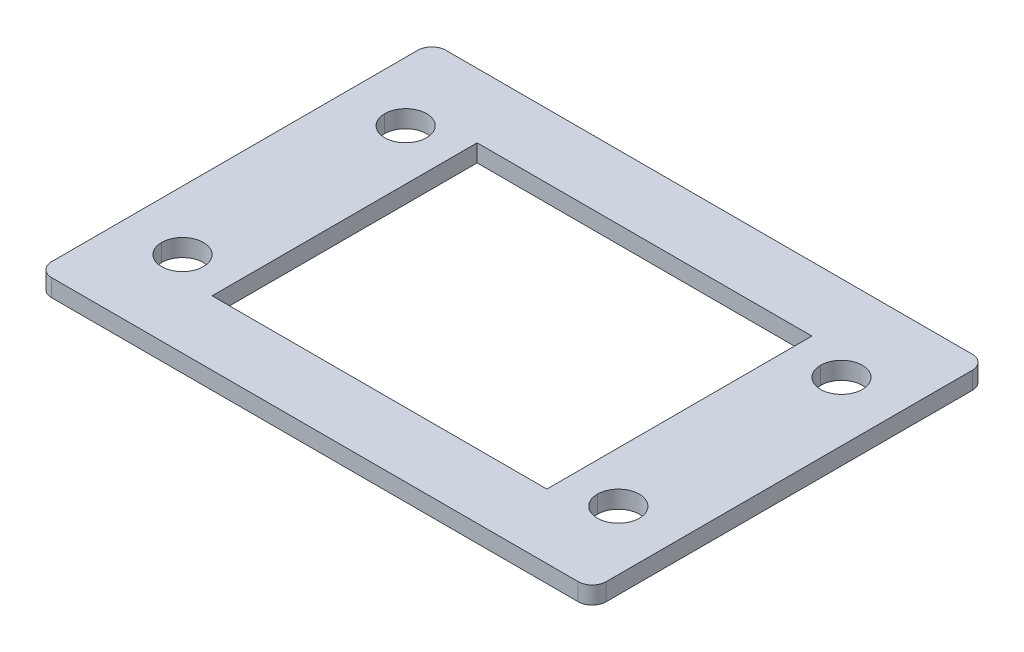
ISO-10303-21;
HEADER;
FILE_DESCRIPTION(('STEP AP214'),'2;1');
FILE_NAME('part.step','',(''),(''),'','','');
FILE_SCHEMA(('AUTOMOTIVE_DESIGN { 1 0 10303 214 1 1 1 1 }'));
ENDSEC;
DATA;
#1=APPLICATION_CONTEXT('core data for automotive mechanical design processes');
#2=APPLICATION_PROTOCOL_DEFINITION('international standard','automotive_design',2000,#1);
#3=PRODUCT_CONTEXT('',#1,'mechanical');
#4=PRODUCT('Part','Part','',(#3));
#5=PRODUCT_RELATED_PRODUCT_CATEGORY('part','',(#4));
#6=PRODUCT_DEFINITION_FORMATION('','',#4);
#7=PRODUCT_DEFINITION_CONTEXT('part definition',#1,'design');
#8=PRODUCT_DEFINITION('design','',#6,#7);
#9=PRODUCT_DEFINITION_SHAPE('','',#8);
#10=(LENGTH_UNIT() NAMED_UNIT(*) SI_UNIT(.MILLI.,.METRE.));
#11=(NAMED_UNIT(*) PLANE_ANGLE_UNIT() SI_UNIT($,.RADIAN.));
#12=(NAMED_UNIT(*) SI_UNIT($,.STERADIAN.) SOLID_ANGLE_UNIT());
#13=UNCERTAINTY_MEASURE_WITH_UNIT(LENGTH_MEASURE(1.E-05),#10,'distance_accuracy_value','');
#14=(GEOMETRIC_REPRESENTATION_CONTEXT(3) GLOBAL_UNCERTAINTY_ASSIGNED_CONTEXT((#13)) GLOBAL_UNIT_ASSIGNED_CONTEXT((#10,
#11,#12)) REPRESENTATION_CONTEXT('',''));
#15=CARTESIAN_POINT('',(0.,0.,0.));
#16=DIRECTION('',(0.,0.,1.));
#17=DIRECTION('',(1.,0.,0.));
#18=AXIS2_PLACEMENT_3D('',#15,#16,#17);
#19=CARTESIAN_POINT('',(31.25,-10.9852813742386,-35.75));
#20=DIRECTION('',(0.,1.,0.));
#21=DIRECTION('',(-1.,0.,0.));
#22=AXIS2_PLACEMENT_3D('',#19,#20,#21);
#23=CYLINDRICAL_SURFACE('',#22,3.);
#24=DIRECTION('',(0.,1.,0.));
#25=VECTOR('',#24,1.);
#26=CARTESIAN_POINT('',(34.25,-10.9852813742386,-35.75));
#27=LINE('',#26,#25);
#28=CARTESIAN_POINT('',(34.25,-2.5,-35.75));
#29=VERTEX_POINT('',#28);
#30=CARTESIAN_POINT('',(34.25,0.,-35.75));
#31=VERTEX_POINT('',#30);
#32=EDGE_CURVE('E209',#29,#31,#27,.T.);
#33=ORIENTED_EDGE('',*,*,#32,.F.);
#34=CARTESIAN_POINT('',(31.25,-2.5,-35.75));
#35=DIRECTION('',(0.,1.,0.));
#36=DIRECTION('',(-1.,0.,0.));
#37=AXIS2_PLACEMENT_3D('',#34,#35,#36);
#38=CIRCLE('',#37,3.);
#39=CARTESIAN_POINT('',(28.25,-2.5,-35.75));
#40=VERTEX_POINT('',#39);
#41=EDGE_CURVE('E195',#40,#29,#38,.T.);
#42=ORIENTED_EDGE('',*,*,#41,.F.);
#43=DIRECTION('',(0.,1.,0.));
#44=VECTOR('',#43,1.);
#45=CARTESIAN_POINT('',(28.25,-10.9852813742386,-35.75));
#46=LINE('',#45,#44);
#47=CARTESIAN_POINT('',(28.25,0.,-35.75));
#48=VERTEX_POINT('',#47);
#49=EDGE_CURVE('E218',#40,#48,#46,.T.);
#50=ORIENTED_EDGE('',*,*,#49,.T.);
#51=CARTESIAN_POINT('',(31.25,0.,-35.75));
#52=DIRECTION('',(0.,-1.,0.));
#53=DIRECTION('',(1.,0.,0.));
#54=AXIS2_PLACEMENT_3D('',#51,#52,#53);
#55=CIRCLE('',#54,3.);
#56=EDGE_CURVE('E210',#31,#48,#55,.T.);
#57=ORIENTED_EDGE('',*,*,#56,.F.);
#58=EDGE_LOOP('',(#33,#42,#50,#57));
#59=FACE_BOUND('',#58,.T.);
#60=ADVANCED_FACE('F15',(#59),#23,.F.);
#61=CARTESIAN_POINT('',(-31.25,-10.9852813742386,-35.75));
#62=DIRECTION('',(0.,1.,0.));
#63=DIRECTION('',(-1.,0.,0.));
#64=AXIS2_PLACEMENT_3D('',#61,#62,#63);
#65=CYLINDRICAL_SURFACE('',#64,3.);
#66=DIRECTION('',(0.,1.,0.));
#67=VECTOR('',#66,1.);
#68=CARTESIAN_POINT('',(-28.25,-10.9852813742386,-35.75));
#69=LINE('',#68,#67);
#70=CARTESIAN_POINT('',(-28.25,-2.5,-35.75));
#71=VERTEX_POINT('',#70);
#72=CARTESIAN_POINT('',(-28.25,0.,-35.75));
#73=VERTEX_POINT('',#72);
#74=EDGE_CURVE('E245',#71,#73,#69,.T.);
#75=ORIENTED_EDGE('',*,*,#74,.F.);
#76=CARTESIAN_POINT('',(-31.25,-2.5,-35.75));
#77=DIRECTION('',(0.,1.,0.));
#78=DIRECTION('',(-1.,0.,0.));
#79=AXIS2_PLACEMENT_3D('',#76,#77,#78);
#80=CIRCLE('',#79,3.);
#81=CARTESIAN_POINT('',(-34.25,-2.5,-35.75));
#82=VERTEX_POINT('',#81);
#83=EDGE_CURVE('E206',#82,#71,#80,.T.);
#84=ORIENTED_EDGE('',*,*,#83,.F.);
#85=DIRECTION('',(0.,1.,0.));
#86=VECTOR('',#85,1.);
#87=CARTESIAN_POINT('',(-34.25,-10.9852813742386,-35.75));
#88=LINE('',#87,#86);
#89=CARTESIAN_POINT('',(-34.25,0.,-35.75));
#90=VERTEX_POINT('',#89);
#91=EDGE_CURVE('E264',#82,#90,#88,.T.);
#92=ORIENTED_EDGE('',*,*,#91,.T.);
#93=CARTESIAN_POINT('',(-31.25,0.,-35.75));
#94=DIRECTION('',(0.,-1.,0.));
#95=DIRECTION('',(1.,0.,0.));
#96=AXIS2_PLACEMENT_3D('',#93,#94,#95);
#97=CIRCLE('',#96,3.);
#98=EDGE_CURVE('E256',#73,#90,#97,.T.);
#99=ORIENTED_EDGE('',*,*,#98,.F.);
#100=EDGE_LOOP('',(#75,#84,#92,#99));
#101=FACE_BOUND('',#100,.T.);
#102=ADVANCED_FACE('F445',(#101),#65,.F.);
#103=CARTESIAN_POINT('',(37.75,-2.5,-25.5));
#104=DIRECTION('',(0.,1.,0.));
#105=DIRECTION('',(-1.,0.,0.));
#106=AXIS2_PLACEMENT_3D('',#103,#104,#105);
#107=CYLINDRICAL_SURFACE('',#106,2.);
#108=CARTESIAN_POINT('',(37.75,-2.5,-25.5));
#109=DIRECTION('',(0.,-1.,0.));
#110=DIRECTION('',(-1.,0.,0.));
#111=AXIS2_PLACEMENT_3D('',#108,#109,#110);
#112=CIRCLE('',#111,2.);
#113=CARTESIAN_POINT('',(39.75,-2.5,-25.5));
#114=VERTEX_POINT('',#113);
#115=CARTESIAN_POINT('',(37.75,-2.5,-23.5));
#116=VERTEX_POINT('',#115);
#117=EDGE_CURVE('E319',#114,#116,#112,.T.);
#118=ORIENTED_EDGE('',*,*,#117,.F.);
#119=DIRECTION('',(0.,-1.,0.));
#120=VECTOR('',#119,1.);
#121=CARTESIAN_POINT('',(39.75,-2.5,-25.5));
#122=LINE('',#121,#120);
#123=CARTESIAN_POINT('',(39.75,0.,-25.5));
#124=VERTEX_POINT('',#123);
#125=EDGE_CURVE('E327',#124,#114,#122,.T.);
#126=ORIENTED_EDGE('',*,*,#125,.F.);
#127=CARTESIAN_POINT('',(37.75,0.,-25.5));
#128=DIRECTION('',(0.,1.,0.));
#129=DIRECTION('',(-1.,0.,0.));
#130=AXIS2_PLACEMENT_3D('',#127,#128,#129);
#131=CIRCLE('',#130,2.);
#132=CARTESIAN_POINT('',(37.75,0.,-23.5));
#133=VERTEX_POINT('',#132);
#134=EDGE_CURVE('E365',#133,#124,#131,.T.);
#135=ORIENTED_EDGE('',*,*,#134,.F.);
#136=DIRECTION('',(0.,1.,0.));
#137=VECTOR('',#136,1.);
#138=CARTESIAN_POINT('',(37.75,-2.5,-23.5));
#139=LINE('',#138,#137);
#140=EDGE_CURVE('E410',#116,#133,#139,.T.);
#141=ORIENTED_EDGE('',*,*,#140,.F.);
#142=EDGE_LOOP('',(#118,#126,#135,#141));
#143=FACE_BOUND('',#142,.T.);
#144=ADVANCED_FACE('F449',(#143),#107,.T.);
#145=CARTESIAN_POINT('',(37.75,-2.5,-78.));
#146=DIRECTION('',(0.,1.,0.));
#147=DIRECTION('',(-1.,0.,0.));
#148=AXIS2_PLACEMENT_3D('',#145,#146,#147);
#149=CYLINDRICAL_SURFACE('',#148,2.);
#150=CARTESIAN_POINT('',(37.75,-2.5,-78.));
#151=DIRECTION('',(0.,-1.,0.));
#152=DIRECTION('',(-1.,0.,0.));
#153=AXIS2_PLACEMENT_3D('',#150,#151,#152);
#154=CIRCLE('',#153,2.);
#155=CARTESIAN_POINT('',(37.75,-2.5,-80.));
#156=VERTEX_POINT('',#155);
#157=CARTESIAN_POINT('',(39.75,-2.5,-78.));
#158=VERTEX_POINT('',#157);
#159=EDGE_CURVE('E311',#156,#158,#154,.T.);
#160=ORIENTED_EDGE('',*,*,#159,.F.);
#161=DIRECTION('',(0.,-1.,0.));
#162=VECTOR('',#161,1.);
#163=CARTESIAN_POINT('',(37.75,-2.5,-80.));
#164=LINE('',#163,#162);
#165=CARTESIAN_POINT('',(37.75,0.,-80.));
#166=VERTEX_POINT('',#165);
#167=EDGE_CURVE('E328',#166,#156,#164,.T.);
#168=ORIENTED_EDGE('',*,*,#167,.F.);
#169=CARTESIAN_POINT('',(37.75,0.,-78.));
#170=DIRECTION('',(0.,1.,0.));
#171=DIRECTION('',(-1.,0.,0.));
#172=AXIS2_PLACEMENT_3D('',#169,#170,#171);
#173=CIRCLE('',#172,2.);
#174=CARTESIAN_POINT('',(39.75,0.,-78.));
#175=VERTEX_POINT('',#174);
#176=EDGE_CURVE('E373',#175,#166,#173,.T.);
#177=ORIENTED_EDGE('',*,*,#176,.F.);
#178=DIRECTION('',(0.,1.,0.));
#179=VECTOR('',#178,1.);
#180=CARTESIAN_POINT('',(39.75,-2.5,-78.));
#181=LINE('',#180,#179);
#182=EDGE_CURVE('E324',#158,#175,#181,.T.);
#183=ORIENTED_EDGE('',*,*,#182,.F.);
#184=EDGE_LOOP('',(#160,#168,#177,#183));
#185=FACE_BOUND('',#184,.T.);
#186=ADVANCED_FACE('F454',(#185),#149,.T.);
#187=CARTESIAN_POINT('',(-37.75,-2.5,-78.));
#188=DIRECTION('',(0.,1.,0.));
#189=DIRECTION('',(-1.,0.,0.));
#190=AXIS2_PLACEMENT_3D('',#187,#188,#189);
#191=CYLINDRICAL_SURFACE('',#190,2.);
#192=CARTESIAN_POINT('',(-37.75,-2.5,-78.));
#193=DIRECTION('',(0.,-1.,0.));
#194=DIRECTION('',(-1.,0.,0.));
#195=AXIS2_PLACEMENT_3D('',#192,#193,#194);
#196=CIRCLE('',#195,2.);
#197=CARTESIAN_POINT('',(-39.75,-2.5,-78.));
#198=VERTEX_POINT('',#197);
#199=CARTESIAN_POINT('',(-37.75,-2.5,-80.));
#200=VERTEX_POINT('',#199);
#201=EDGE_CURVE('E299',#198,#200,#196,.T.);
#202=ORIENTED_EDGE('',*,*,#201,.F.);
#203=DIRECTION('',(0.,-1.,0.));
#204=VECTOR('',#203,1.);
#205=CARTESIAN_POINT('',(-39.75,-2.5,-78.));
#206=LINE('',#205,#204);
#207=CARTESIAN_POINT('',(-39.75,0.,-78.));
#208=VERTEX_POINT('',#207);
#209=EDGE_CURVE('E307',#208,#198,#206,.T.);
#210=ORIENTED_EDGE('',*,*,#209,.F.);
#211=CARTESIAN_POINT('',(-37.75,0.,-78.));
#212=DIRECTION('',(0.,1.,0.));
#213=DIRECTION('',(-1.,0.,0.));
#214=AXIS2_PLACEMENT_3D('',#211,#212,#213);
#215=CIRCLE('',#214,2.);
#216=CARTESIAN_POINT('',(-37.75,0.,-80.));
#217=VERTEX_POINT('',#216);
#218=EDGE_CURVE('E260',#217,#208,#215,.T.);
#219=ORIENTED_EDGE('',*,*,#218,.F.);
#220=DIRECTION('',(0.,1.,0.));
#221=VECTOR('',#220,1.);
#222=CARTESIAN_POINT('',(-37.75,-2.5,-80.));
#223=LINE('',#222,#221);
#224=EDGE_CURVE('E400',#200,#217,#223,.T.);
#225=ORIENTED_EDGE('',*,*,#224,.F.);
#226=EDGE_LOOP('',(#202,#210,#219,#225));
#227=FACE_BOUND('',#226,.T.);
#228=ADVANCED_FACE('F461',(#227),#191,.T.);
#229=CARTESIAN_POINT('',(-37.75,-2.5,-25.5));
#230=DIRECTION('',(0.,1.,0.));
#231=DIRECTION('',(-1.,0.,0.));
#232=AXIS2_PLACEMENT_3D('',#229,#230,#231);
#233=CYLINDRICAL_SURFACE('',#232,2.);
#234=CARTESIAN_POINT('',(-37.75,-2.5,-25.5));
#235=DIRECTION('',(0.,-1.,0.));
#236=DIRECTION('',(-1.,0.,0.));
#237=AXIS2_PLACEMENT_3D('',#234,#235,#236);
#238=CIRCLE('',#237,2.);
#239=CARTESIAN_POINT('',(-37.75,-2.5,-23.5));
#240=VERTEX_POINT('',#239);
#241=CARTESIAN_POINT('',(-39.75,-2.5,-25.5));
#242=VERTEX_POINT('',#241);
#243=EDGE_CURVE('E291',#240,#242,#238,.T.);
#244=ORIENTED_EDGE('',*,*,#243,.F.);
#245=DIRECTION('',(0.,-1.,0.));
#246=VECTOR('',#245,1.);
#247=CARTESIAN_POINT('',(-37.75,-2.5,-23.5));
#248=LINE('',#247,#246);
#249=CARTESIAN_POINT('',(-37.75,0.,-23.5));
#250=VERTEX_POINT('',#249);
#251=EDGE_CURVE('E407',#250,#240,#248,.T.);
#252=ORIENTED_EDGE('',*,*,#251,.F.);
#253=CARTESIAN_POINT('',(-37.75,0.,-25.5));
#254=DIRECTION('',(0.,1.,0.));
#255=DIRECTION('',(-1.,0.,0.));
#256=AXIS2_PLACEMENT_3D('',#253,#254,#255);
#257=CIRCLE('',#256,2.);
#258=CARTESIAN_POINT('',(-39.75,0.,-25.5));
#259=VERTEX_POINT('',#258);
#260=EDGE_CURVE('E357',#259,#250,#257,.T.);
#261=ORIENTED_EDGE('',*,*,#260,.F.);
#262=DIRECTION('',(0.,1.,0.));
#263=VECTOR('',#262,1.);
#264=CARTESIAN_POINT('',(-39.75,-2.5,-25.5));
#265=LINE('',#264,#263);
#266=EDGE_CURVE('E304',#242,#259,#265,.T.);
#267=ORIENTED_EDGE('',*,*,#266,.F.);
#268=EDGE_LOOP('',(#244,#252,#261,#267));
#269=FACE_BOUND('',#268,.T.);
#270=ADVANCED_FACE('F465',(#269),#233,.T.);
#271=CARTESIAN_POINT('',(31.25,-63.7209114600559,-67.75));
#272=DIRECTION('',(0.,1.,0.));
#273=DIRECTION('',(-1.,0.,0.));
#274=AXIS2_PLACEMENT_3D('',#271,#272,#273);
#275=CYLINDRICAL_SURFACE('',#274,3.);
#276=DIRECTION('',(0.,1.,0.));
#277=VECTOR('',#276,1.);
#278=CARTESIAN_POINT('',(34.25,-63.7209114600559,-67.75));
#279=LINE('',#278,#277);
#280=CARTESIAN_POINT('',(34.25,-2.5,-67.75));
#281=VERTEX_POINT('',#280);
#282=CARTESIAN_POINT('',(34.25,0.,-67.75));
#283=VERTEX_POINT('',#282);
#284=EDGE_CURVE('E223',#281,#283,#279,.T.);
#285=ORIENTED_EDGE('',*,*,#284,.F.);
#286=CARTESIAN_POINT('',(31.25,-2.5,-67.75));
#287=DIRECTION('',(0.,1.,0.));
#288=DIRECTION('',(-1.,0.,0.));
#289=AXIS2_PLACEMENT_3D('',#286,#287,#288);
#290=CIRCLE('',#289,3.);
#291=CARTESIAN_POINT('',(28.25,-2.5,-67.75));
#292=VERTEX_POINT('',#291);
#293=EDGE_CURVE('E229',#292,#281,#290,.T.);
#294=ORIENTED_EDGE('',*,*,#293,.F.);
#295=DIRECTION('',(0.,1.,0.));
#296=VECTOR('',#295,1.);
#297=CARTESIAN_POINT('',(28.25,-63.7209114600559,-67.75));
#298=LINE('',#297,#296);
#299=CARTESIAN_POINT('',(28.25,0.,-67.75));
#300=VERTEX_POINT('',#299);
#301=EDGE_CURVE('E238',#292,#300,#298,.T.);
#302=ORIENTED_EDGE('',*,*,#301,.T.);
#303=CARTESIAN_POINT('',(31.25,0.,-67.75));
#304=DIRECTION('',(0.,-1.,0.));
#305=DIRECTION('',(-1.,0.,0.));
#306=AXIS2_PLACEMENT_3D('',#303,#304,#305);
#307=CIRCLE('',#306,3.);
#308=EDGE_CURVE('E345',#283,#300,#307,.T.);
#309=ORIENTED_EDGE('',*,*,#308,.F.);
#310=EDGE_LOOP('',(#285,#294,#302,#309));
#311=FACE_BOUND('',#310,.T.);
#312=ADVANCED_FACE('F469',(#311),#275,.F.);
#313=CARTESIAN_POINT('',(-31.25,-63.7209114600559,-67.75));
#314=DIRECTION('',(0.,1.,0.));
#315=DIRECTION('',(-1.,0.,0.));
#316=AXIS2_PLACEMENT_3D('',#313,#314,#315);
#317=CYLINDRICAL_SURFACE('',#316,3.);
#318=DIRECTION('',(0.,1.,0.));
#319=VECTOR('',#318,1.);
#320=CARTESIAN_POINT('',(-28.25,-63.7209114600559,-67.75));
#321=LINE('',#320,#319);
#322=CARTESIAN_POINT('',(-28.25,-2.5,-67.75));
#323=VERTEX_POINT('',#322);
#324=CARTESIAN_POINT('',(-28.25,0.,-67.75));
#325=VERTEX_POINT('',#324);
#326=EDGE_CURVE('E250',#323,#325,#321,.T.);
#327=ORIENTED_EDGE('',*,*,#326,.F.);
#328=CARTESIAN_POINT('',(-31.25,-2.5,-67.75));
#329=DIRECTION('',(0.,1.,0.));
#330=DIRECTION('',(-1.,0.,0.));
#331=AXIS2_PLACEMENT_3D('',#328,#329,#330);
#332=CIRCLE('',#331,3.);
#333=CARTESIAN_POINT('',(-34.25,-2.5,-67.75));
#334=VERTEX_POINT('',#333);
#335=EDGE_CURVE('E232',#334,#323,#332,.T.);
#336=ORIENTED_EDGE('',*,*,#335,.F.);
#337=DIRECTION('',(0.,1.,0.));
#338=VECTOR('',#337,1.);
#339=CARTESIAN_POINT('',(-34.25,-63.7209114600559,-67.75));
#340=LINE('',#339,#338);
#341=CARTESIAN_POINT('',(-34.25,0.,-67.75));
#342=VERTEX_POINT('',#341);
#343=EDGE_CURVE('E268',#334,#342,#340,.T.);
#344=ORIENTED_EDGE('',*,*,#343,.T.);
#345=CARTESIAN_POINT('',(-31.25,0.,-67.75));
#346=DIRECTION('',(0.,-1.,0.));
#347=DIRECTION('',(1.,0.,0.));
#348=AXIS2_PLACEMENT_3D('',#345,#346,#347);
#349=CIRCLE('',#348,3.);
#350=EDGE_CURVE('E259',#325,#342,#349,.T.);
#351=ORIENTED_EDGE('',*,*,#350,.F.);
#352=EDGE_LOOP('',(#327,#336,#344,#351));
#353=FACE_BOUND('',#352,.T.);
#354=ADVANCED_FACE('F473',(#353),#317,.F.);
#355=CARTESIAN_POINT('',(-24.,-63.7209114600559,-70.75));
#356=DIRECTION('',(1.,0.,0.));
#357=DIRECTION('',(0.,0.,1.));
#358=AXIS2_PLACEMENT_3D('',#355,#356,#357);
#359=PLANE('',#358);
#360=DIRECTION('',(0.,1.,0.));
#361=VECTOR('',#360,1.);
#362=CARTESIAN_POINT('',(-24.,-63.7209114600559,-70.75));
#363=LINE('',#362,#361);
#364=CARTESIAN_POINT('',(-24.,-2.5,-70.75));
#365=VERTEX_POINT('',#364);
#366=CARTESIAN_POINT('',(-24.,0.,-70.75));
#367=VERTEX_POINT('',#366);
#368=EDGE_CURVE('E10',#365,#367,#363,.T.);
#369=ORIENTED_EDGE('',*,*,#368,.T.);
#370=DIRECTION('',(0.,0.,-1.));
#371=VECTOR('',#370,1.);
#372=CARTESIAN_POINT('',(-24.,0.,-70.75));
#373=LINE('',#372,#371);
#374=CARTESIAN_POINT('',(-24.,0.,-32.75));
#375=VERTEX_POINT('',#374);
#376=EDGE_CURVE('E346',#375,#367,#373,.T.);
#377=ORIENTED_EDGE('',*,*,#376,.F.);
#378=DIRECTION('',(0.,1.,0.));
#379=VECTOR('',#378,1.);
#380=CARTESIAN_POINT('',(-24.,-63.7209114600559,-32.75));
#381=LINE('',#380,#379);
#382=CARTESIAN_POINT('',(-24.,-2.5,-32.75));
#383=VERTEX_POINT('',#382);
#384=EDGE_CURVE('E42',#383,#375,#381,.T.);
#385=ORIENTED_EDGE('',*,*,#384,.F.);
#386=DIRECTION('',(0.,0.,1.));
#387=VECTOR('',#386,1.);
#388=CARTESIAN_POINT('',(-24.,-2.5,-70.75));
#389=LINE('',#388,#387);
#390=EDGE_CURVE('E340',#365,#383,#389,.T.);
#391=ORIENTED_EDGE('',*,*,#390,.F.);
#392=EDGE_LOOP('',(#369,#377,#385,#391));
#393=FACE_BOUND('',#392,.T.);
#394=ADVANCED_FACE('F477',(#393),#359,.T.);
#395=CARTESIAN_POINT('',(-24.,-63.7209114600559,-70.75));
#396=DIRECTION('',(0.,0.,1.));
#397=DIRECTION('',(1.,0.,0.));
#398=AXIS2_PLACEMENT_3D('',#395,#396,#397);
#399=PLANE('',#398);
#400=DIRECTION('',(0.,1.,0.));
#401=VECTOR('',#400,1.);
#402=CARTESIAN_POINT('',(24.,-63.7209114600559,-70.75));
#403=LINE('',#402,#401);
#404=CARTESIAN_POINT('',(24.,-2.5,-70.75));
#405=VERTEX_POINT('',#404);
#406=CARTESIAN_POINT('',(24.,0.,-70.75));
#407=VERTEX_POINT('',#406);
#408=EDGE_CURVE('E23',#405,#407,#403,.T.);
#409=ORIENTED_EDGE('',*,*,#408,.T.);
#410=DIRECTION('',(1.,0.,0.));
#411=VECTOR('',#410,1.);
#412=CARTESIAN_POINT('',(-24.,0.,-70.75));
#413=LINE('',#412,#411);
#414=EDGE_CURVE('E341',#367,#407,#413,.T.);
#415=ORIENTED_EDGE('',*,*,#414,.F.);
#416=ORIENTED_EDGE('',*,*,#368,.F.);
#417=DIRECTION('',(-1.,0.,0.));
#418=VECTOR('',#417,1.);
#419=CARTESIAN_POINT('',(-24.,-2.5,-70.75));
#420=LINE('',#419,#418);
#421=EDGE_CURVE('E336',#405,#365,#420,.T.);
#422=ORIENTED_EDGE('',*,*,#421,.F.);
#423=EDGE_LOOP('',(#409,#415,#416,#422));
#424=FACE_BOUND('',#423,.T.);
#425=ADVANCED_FACE('F421',(#424),#399,.T.);
#426=CARTESIAN_POINT('',(24.,-63.7209114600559,-70.75));
#427=DIRECTION('',(-1.,0.,0.));
#428=DIRECTION('',(0.,-1.,0.));
#429=AXIS2_PLACEMENT_3D('',#426,#427,#428);
#430=PLANE('',#429);
#431=DIRECTION('',(0.,1.,0.));
#432=VECTOR('',#431,1.);
#433=CARTESIAN_POINT('',(24.,-63.7209114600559,-32.75));
#434=LINE('',#433,#432);
#435=CARTESIAN_POINT('',(24.,-2.5,-32.75));
#436=VERTEX_POINT('',#435);
#437=CARTESIAN_POINT('',(24.,0.,-32.75));
#438=VERTEX_POINT('',#437);
#439=EDGE_CURVE('E415',#436,#438,#434,.T.);
#440=ORIENTED_EDGE('',*,*,#439,.T.);
#441=DIRECTION('',(0.,0.,1.));
#442=VECTOR('',#441,1.);
#443=CARTESIAN_POINT('',(24.,0.,-70.75));
#444=LINE('',#443,#442);
#445=EDGE_CURVE('E271',#407,#438,#444,.T.);
#446=ORIENTED_EDGE('',*,*,#445,.F.);
#447=ORIENTED_EDGE('',*,*,#408,.F.);
#448=DIRECTION('',(0.,0.,-1.));
#449=VECTOR('',#448,1.);
#450=CARTESIAN_POINT('',(24.,-2.5,-70.75));
#451=LINE('',#450,#449);
#452=EDGE_CURVE('E332',#436,#405,#451,.T.);
#453=ORIENTED_EDGE('',*,*,#452,.F.);
#454=EDGE_LOOP('',(#440,#446,#447,#453));
#455=FACE_BOUND('',#454,.T.);
#456=ADVANCED_FACE('F428',(#455),#430,.T.);
#457=CARTESIAN_POINT('',(-24.,-63.7209114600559,-32.75));
#458=DIRECTION('',(0.,0.,-1.));
#459=DIRECTION('',(0.,1.,0.));
#460=AXIS2_PLACEMENT_3D('',#457,#458,#459);
#461=PLANE('',#460);
#462=ORIENTED_EDGE('',*,*,#384,.T.);
#463=DIRECTION('',(-1.,0.,0.));
#464=VECTOR('',#463,1.);
#465=CARTESIAN_POINT('',(-24.,0.,-32.75));
#466=LINE('',#465,#464);
#467=EDGE_CURVE('E387',#438,#375,#466,.T.);
#468=ORIENTED_EDGE('',*,*,#467,.F.);
#469=ORIENTED_EDGE('',*,*,#439,.F.);
#470=DIRECTION('',(1.,0.,0.));
#471=VECTOR('',#470,1.);
#472=CARTESIAN_POINT('',(-24.,-2.5,-32.75));
#473=LINE('',#472,#471);
#474=EDGE_CURVE('E323',#383,#436,#473,.T.);
#475=ORIENTED_EDGE('',*,*,#474,.F.);
#476=EDGE_LOOP('',(#462,#468,#469,#475));
#477=FACE_BOUND('',#476,.T.);
#478=ADVANCED_FACE('F429',(#477),#461,.T.);
#479=CARTESIAN_POINT('',(-39.75,-2.5,-23.5));
#480=DIRECTION('',(0.,0.,-1.));
#481=DIRECTION('',(0.,1.,0.));
#482=AXIS2_PLACEMENT_3D('',#479,#480,#481);
#483=PLANE('',#482);
#484=DIRECTION('',(-1.,0.,0.));
#485=VECTOR('',#484,1.);
#486=CARTESIAN_POINT('',(-39.75,0.,-23.5));
#487=LINE('',#486,#485);
#488=EDGE_CURVE('E361',#133,#250,#487,.T.);
#489=ORIENTED_EDGE('',*,*,#488,.T.);
#490=ORIENTED_EDGE('',*,*,#251,.T.);
#491=DIRECTION('',(-1.,0.,0.));
#492=VECTOR('',#491,1.);
#493=CARTESIAN_POINT('',(-39.75,-2.5,-23.5));
#494=LINE('',#493,#492);
#495=EDGE_CURVE('E287',#116,#240,#494,.T.);
#496=ORIENTED_EDGE('',*,*,#495,.F.);
#497=ORIENTED_EDGE('',*,*,#140,.T.);
#498=EDGE_LOOP('',(#489,#490,#496,#497));
#499=FACE_BOUND('',#498,.T.);
#500=ADVANCED_FACE('F431',(#499),#483,.F.);
#501=CARTESIAN_POINT('',(39.75,-2.5,-80.));
#502=DIRECTION('',(-1.,0.,0.));
#503=DIRECTION('',(0.,-1.,0.));
#504=AXIS2_PLACEMENT_3D('',#501,#502,#503);
#505=PLANE('',#504);
#506=DIRECTION('',(0.,0.,1.));
#507=VECTOR('',#506,1.);
#508=CARTESIAN_POINT('',(39.75,-2.5,-80.));
#509=LINE('',#508,#507);
#510=EDGE_CURVE('E315',#158,#114,#509,.T.);
#511=ORIENTED_EDGE('',*,*,#510,.F.);
#512=ORIENTED_EDGE('',*,*,#182,.T.);
#513=DIRECTION('',(0.,0.,1.));
#514=VECTOR('',#513,1.);
#515=CARTESIAN_POINT('',(39.75,0.,-80.));
#516=LINE('',#515,#514);
#517=EDGE_CURVE('E369',#175,#124,#516,.T.);
#518=ORIENTED_EDGE('',*,*,#517,.T.);
#519=ORIENTED_EDGE('',*,*,#125,.T.);
#520=EDGE_LOOP('',(#511,#512,#518,#519));
#521=FACE_BOUND('',#520,.T.);
#522=ADVANCED_FACE('F438',(#521),#505,.F.);
#523=CARTESIAN_POINT('',(-39.75,-2.5,-80.));
#524=DIRECTION('',(0.,0.,1.));
#525=DIRECTION('',(1.,0.,0.));
#526=AXIS2_PLACEMENT_3D('',#523,#524,#525);
#527=PLANE('',#526);
#528=DIRECTION('',(1.,0.,0.));
#529=VECTOR('',#528,1.);
#530=CARTESIAN_POINT('',(-39.75,-2.5,-80.));
#531=LINE('',#530,#529);
#532=EDGE_CURVE('E303',#200,#156,#531,.T.);
#533=ORIENTED_EDGE('',*,*,#532,.F.);
#534=ORIENTED_EDGE('',*,*,#224,.T.);
#535=DIRECTION('',(1.,0.,0.));
#536=VECTOR('',#535,1.);
#537=CARTESIAN_POINT('',(-39.75,0.,-80.));
#538=LINE('',#537,#536);
#539=EDGE_CURVE('E377',#217,#166,#538,.T.);
#540=ORIENTED_EDGE('',*,*,#539,.T.);
#541=ORIENTED_EDGE('',*,*,#167,.T.);
#542=EDGE_LOOP('',(#533,#534,#540,#541));
#543=FACE_BOUND('',#542,.T.);
#544=ADVANCED_FACE('F481',(#543),#527,.F.);
#545=CARTESIAN_POINT('',(-39.75,-2.5,-80.));
#546=DIRECTION('',(1.,0.,0.));
#547=DIRECTION('',(0.,0.,1.));
#548=AXIS2_PLACEMENT_3D('',#545,#546,#547);
#549=PLANE('',#548);
#550=DIRECTION('',(0.,0.,-1.));
#551=VECTOR('',#550,1.);
#552=CARTESIAN_POINT('',(-39.75,-2.5,-80.));
#553=LINE('',#552,#551);
#554=EDGE_CURVE('E295',#242,#198,#553,.T.);
#555=ORIENTED_EDGE('',*,*,#554,.F.);
#556=ORIENTED_EDGE('',*,*,#266,.T.);
#557=DIRECTION('',(0.,0.,-1.));
#558=VECTOR('',#557,1.);
#559=CARTESIAN_POINT('',(-39.75,0.,-80.));
#560=LINE('',#559,#558);
#561=EDGE_CURVE('E205',#259,#208,#560,.T.);
#562=ORIENTED_EDGE('',*,*,#561,.T.);
#563=ORIENTED_EDGE('',*,*,#209,.T.);
#564=EDGE_LOOP('',(#555,#556,#562,#563));
#565=FACE_BOUND('',#564,.T.);
#566=ADVANCED_FACE('F483',(#565),#549,.F.);
#567=CARTESIAN_POINT('',(-39.75,0.,-23.5));
#568=DIRECTION('',(0.,1.,0.));
#569=DIRECTION('',(0.,0.,-1.));
#570=AXIS2_PLACEMENT_3D('',#567,#568,#569);
#571=PLANE('',#570);
#572=CARTESIAN_POINT('',(31.25,0.,-35.75));
#573=DIRECTION('',(0.,-1.,0.));
#574=DIRECTION('',(1.,0.,0.));
#575=AXIS2_PLACEMENT_3D('',#572,#573,#574);
#576=CIRCLE('',#575,3.);
#577=EDGE_CURVE('E215',#48,#31,#576,.T.);
#578=ORIENTED_EDGE('',*,*,#577,.T.);
#579=ORIENTED_EDGE('',*,*,#56,.T.);
#580=EDGE_LOOP('',(#578,#579));
#581=FACE_BOUND('',#580,.T.);
#582=CARTESIAN_POINT('',(31.25,0.,-67.75));
#583=DIRECTION('',(0.,-1.,0.));
#584=DIRECTION('',(-1.,0.,0.));
#585=AXIS2_PLACEMENT_3D('',#582,#583,#584);
#586=CIRCLE('',#585,3.);
#587=EDGE_CURVE('E227',#300,#283,#586,.T.);
#588=ORIENTED_EDGE('',*,*,#587,.T.);
#589=ORIENTED_EDGE('',*,*,#308,.T.);
#590=EDGE_LOOP('',(#588,#589));
#591=FACE_BOUND('',#590,.T.);
#592=ORIENTED_EDGE('',*,*,#445,.T.);
#593=ORIENTED_EDGE('',*,*,#467,.T.);
#594=ORIENTED_EDGE('',*,*,#376,.T.);
#595=ORIENTED_EDGE('',*,*,#414,.T.);
#596=EDGE_LOOP('',(#592,#593,#594,#595));
#597=FACE_BOUND('',#596,.T.);
#598=CARTESIAN_POINT('',(-31.25,0.,-67.75));
#599=DIRECTION('',(0.,-1.,0.));
#600=DIRECTION('',(1.,0.,0.));
#601=AXIS2_PLACEMENT_3D('',#598,#599,#600);
#602=CIRCLE('',#601,3.);
#603=EDGE_CURVE('E254',#342,#325,#602,.T.);
#604=ORIENTED_EDGE('',*,*,#603,.T.);
#605=ORIENTED_EDGE('',*,*,#350,.T.);
#606=EDGE_LOOP('',(#604,#605));
#607=FACE_BOUND('',#606,.T.);
#608=CARTESIAN_POINT('',(-31.25,0.,-35.75));
#609=DIRECTION('',(0.,-1.,0.));
#610=DIRECTION('',(1.,0.,0.));
#611=AXIS2_PLACEMENT_3D('',#608,#609,#610);
#612=CIRCLE('',#611,3.);
#613=EDGE_CURVE('E249',#90,#73,#612,.T.);
#614=ORIENTED_EDGE('',*,*,#613,.T.);
#615=ORIENTED_EDGE('',*,*,#98,.T.);
#616=EDGE_LOOP('',(#614,#615));
#617=FACE_BOUND('',#616,.T.);
#618=ORIENTED_EDGE('',*,*,#561,.F.);
#619=ORIENTED_EDGE('',*,*,#260,.T.);
#620=ORIENTED_EDGE('',*,*,#488,.F.);
#621=ORIENTED_EDGE('',*,*,#134,.T.);
#622=ORIENTED_EDGE('',*,*,#517,.F.);
#623=ORIENTED_EDGE('',*,*,#176,.T.);
#624=ORIENTED_EDGE('',*,*,#539,.F.);
#625=ORIENTED_EDGE('',*,*,#218,.T.);
#626=EDGE_LOOP('',(#618,#619,#620,#621,#622,#623,#624,#625));
#627=FACE_BOUND('',#626,.T.);
#628=ADVANCED_FACE('F426',(#581,#591,#597,#607,#617,#627),#571,.T.);
#629=CARTESIAN_POINT('',(-39.75,-2.5,-23.5));
#630=DIRECTION('',(0.,1.,0.));
#631=DIRECTION('',(0.,0.,-1.));
#632=AXIS2_PLACEMENT_3D('',#629,#630,#631);
#633=PLANE('',#632);
#634=ORIENTED_EDGE('',*,*,#41,.T.);
#635=CARTESIAN_POINT('',(31.25,-2.5,-35.75));
#636=DIRECTION('',(0.,1.,0.));
#637=DIRECTION('',(-1.,0.,0.));
#638=AXIS2_PLACEMENT_3D('',#635,#636,#637);
#639=CIRCLE('',#638,3.);
#640=EDGE_CURVE('E200',#29,#40,#639,.T.);
#641=ORIENTED_EDGE('',*,*,#640,.T.);
#642=EDGE_LOOP('',(#634,#641));
#643=FACE_BOUND('',#642,.T.);
#644=ORIENTED_EDGE('',*,*,#83,.T.);
#645=CARTESIAN_POINT('',(-31.25,-2.5,-35.75));
#646=DIRECTION('',(0.,1.,0.));
#647=DIRECTION('',(-1.,0.,0.));
#648=AXIS2_PLACEMENT_3D('',#645,#646,#647);
#649=CIRCLE('',#648,3.);
#650=EDGE_CURVE('E241',#71,#82,#649,.T.);
#651=ORIENTED_EDGE('',*,*,#650,.T.);
#652=EDGE_LOOP('',(#644,#651));
#653=FACE_BOUND('',#652,.T.);
#654=ORIENTED_EDGE('',*,*,#293,.T.);
#655=CARTESIAN_POINT('',(31.25,-2.5,-67.75));
#656=DIRECTION('',(0.,1.,0.));
#657=DIRECTION('',(-1.,0.,0.));
#658=AXIS2_PLACEMENT_3D('',#655,#656,#657);
#659=CIRCLE('',#658,3.);
#660=EDGE_CURVE('E228',#281,#292,#659,.T.);
#661=ORIENTED_EDGE('',*,*,#660,.T.);
#662=EDGE_LOOP('',(#654,#661));
#663=FACE_BOUND('',#662,.T.);
#664=ORIENTED_EDGE('',*,*,#335,.T.);
#665=CARTESIAN_POINT('',(-31.25,-2.5,-67.75));
#666=DIRECTION('',(0.,1.,0.));
#667=DIRECTION('',(-1.,0.,0.));
#668=AXIS2_PLACEMENT_3D('',#665,#666,#667);
#669=CIRCLE('',#668,3.);
#670=EDGE_CURVE('E255',#323,#334,#669,.T.);
#671=ORIENTED_EDGE('',*,*,#670,.T.);
#672=EDGE_LOOP('',(#664,#671));
#673=FACE_BOUND('',#672,.T.);
#674=ORIENTED_EDGE('',*,*,#474,.T.);
#675=ORIENTED_EDGE('',*,*,#452,.T.);
#676=ORIENTED_EDGE('',*,*,#421,.T.);
#677=ORIENTED_EDGE('',*,*,#390,.T.);
#678=EDGE_LOOP('',(#674,#675,#676,#677));
#679=FACE_BOUND('',#678,.T.);
#680=ORIENTED_EDGE('',*,*,#495,.T.);
#681=ORIENTED_EDGE('',*,*,#243,.T.);
#682=ORIENTED_EDGE('',*,*,#554,.T.);
#683=ORIENTED_EDGE('',*,*,#201,.T.);
#684=ORIENTED_EDGE('',*,*,#532,.T.);
#685=ORIENTED_EDGE('',*,*,#159,.T.);
#686=ORIENTED_EDGE('',*,*,#510,.T.);
#687=ORIENTED_EDGE('',*,*,#117,.T.);
#688=EDGE_LOOP('',(#680,#681,#682,#683,#684,#685,#686,#687));
#689=FACE_BOUND('',#688,.T.);
#690=ADVANCED_FACE('F197',(#643,#653,#663,#673,#679,#689),#633,.F.);
#691=CARTESIAN_POINT('',(-31.25,-63.7209114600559,-67.75));
#692=DIRECTION('',(0.,1.,0.));
#693=DIRECTION('',(-1.,0.,0.));
#694=AXIS2_PLACEMENT_3D('',#691,#692,#693);
#695=CYLINDRICAL_SURFACE('',#694,3.);
#696=ORIENTED_EDGE('',*,*,#670,.F.);
#697=ORIENTED_EDGE('',*,*,#326,.T.);
#698=ORIENTED_EDGE('',*,*,#603,.F.);
#699=ORIENTED_EDGE('',*,*,#343,.F.);
#700=EDGE_LOOP('',(#696,#697,#698,#699));
#701=FACE_BOUND('',#700,.T.);
#702=ADVANCED_FACE('F515',(#701),#695,.F.);
#703=CARTESIAN_POINT('',(31.25,-63.7209114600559,-67.75));
#704=DIRECTION('',(0.,1.,0.));
#705=DIRECTION('',(-1.,0.,0.));
#706=AXIS2_PLACEMENT_3D('',#703,#704,#705);
#707=CYLINDRICAL_SURFACE('',#706,3.);
#708=ORIENTED_EDGE('',*,*,#660,.F.);
#709=ORIENTED_EDGE('',*,*,#284,.T.);
#710=ORIENTED_EDGE('',*,*,#587,.F.);
#711=ORIENTED_EDGE('',*,*,#301,.F.);
#712=EDGE_LOOP('',(#708,#709,#710,#711));
#713=FACE_BOUND('',#712,.T.);
#714=ADVANCED_FACE('F523',(#713),#707,.F.);
#715=CARTESIAN_POINT('',(-31.25,-10.9852813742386,-35.75));
#716=DIRECTION('',(0.,1.,0.));
#717=DIRECTION('',(-1.,0.,0.));
#718=AXIS2_PLACEMENT_3D('',#715,#716,#717);
#719=CYLINDRICAL_SURFACE('',#718,3.);
#720=ORIENTED_EDGE('',*,*,#650,.F.);
#721=ORIENTED_EDGE('',*,*,#74,.T.);
#722=ORIENTED_EDGE('',*,*,#613,.F.);
#723=ORIENTED_EDGE('',*,*,#91,.F.);
#724=EDGE_LOOP('',(#720,#721,#722,#723));
#725=FACE_BOUND('',#724,.T.);
#726=ADVANCED_FACE('F527',(#725),#719,.F.);
#727=CARTESIAN_POINT('',(31.25,-10.9852813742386,-35.75));
#728=DIRECTION('',(0.,1.,0.));
#729=DIRECTION('',(-1.,0.,0.));
#730=AXIS2_PLACEMENT_3D('',#727,#728,#729);
#731=CYLINDRICAL_SURFACE('',#730,3.);
#732=ORIENTED_EDGE('',*,*,#640,.F.);
#733=ORIENTED_EDGE('',*,*,#32,.T.);
#734=ORIENTED_EDGE('',*,*,#577,.F.);
#735=ORIENTED_EDGE('',*,*,#49,.F.);
#736=EDGE_LOOP('',(#732,#733,#734,#735));
#737=FACE_BOUND('',#736,.T.);
#738=ADVANCED_FACE('F217',(#737),#731,.F.);
#739=CLOSED_SHELL('',(#60,#102,#144,#186,#228,#270,#312,#354,#394,#425,#456,#478,#500,#522,#544,
#566,#628,#690,#702,#714,#726,#738));
#740=MANIFOLD_SOLID_BREP('B1',#739);
#741=ADVANCED_BREP_SHAPE_REPRESENTATION('',(#18,#740),#14);
#742=SHAPE_DEFINITION_REPRESENTATION(#9,#741);
ENDSEC;
END-ISO-10303-21;
